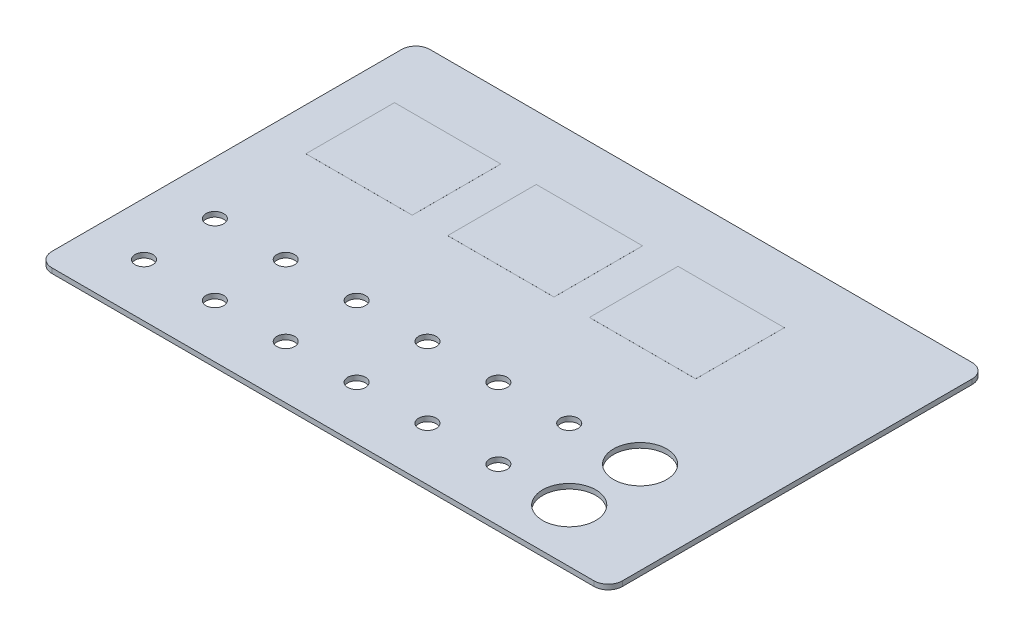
from build123d import *

# Parameters (mm, degrees)
SKETCH1_W           = 161
SKETCH1_H           = 106.7
BOSS_EXTRUDE1_DEPTH = 1.4
SKETCH2_R           = 2.5
SKETCH2_R_2         = 7.5
CUT_EXTRUDE1_DEPTH  = 195.336115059
SKETCH3_W           = 30
SKETCH3_H           = 25
BOSS_EXTRUDE2_DEPTH = 0.01
FILLET1_R           = 4


with BuildPart() as part:
    # Sketch1 → Boss-Extrude1 (new body)
    with BuildSketch(Plane(origin=(-75.623841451, 0, 44.972291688), x_dir=(1, 0, 0), z_dir=(0, 1, 0))):
        with Locations((81.418091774, 54.107420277)):
            Rectangle(SKETCH1_W, SKETCH1_H)
    extrude(amount=BOSS_EXTRUDE1_DEPTH)

    # Sketch2 → Cut-Extrude1 (cut, through all)
    with BuildSketch(Plane(origin=(-75.623841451, 1.4, 44.972291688), x_dir=(1, 0, 0), z_dir=(0, 1, 0))):
        with Locations(Location((15.918091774, 15.757420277, 0), (0, 0, 270))):
            Circle(SKETCH2_R)
        with Locations(Location((15.918091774, 35.757420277, 0), (0, 0, 270))):
            Circle(SKETCH2_R)
        with Locations(Location((35.918091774, 15.757420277, 0), (0, 0, 270))):
            Circle(SKETCH2_R)
        with Locations(Location((35.918091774, 35.757420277, 0), (0, 0, 270))):
            Circle(SKETCH2_R)
        with Locations(Location((55.918091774, 35.757420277, 0), (0, 0, 270))):
            Circle(SKETCH2_R)
        with Locations(Location((55.918091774, 15.757420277, 0), (0, 0, 270))):
            Circle(SKETCH2_R)
        with Locations(Location((75.918091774, 15.757420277, 0), (0, 0, 270))):
            Circle(SKETCH2_R)
        with Locations(Location((75.918091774, 35.757420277, 0), (0, 0, 270))):
            Circle(SKETCH2_R)
        with Locations(Location((95.918091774, 15.757420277, 0), (0, 0, 270))):
            Circle(SKETCH2_R)
        with Locations(Location((95.918091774, 35.757420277, 0), (0, 0, 270))):
            Circle(SKETCH2_R)
        with Locations(Location((115.918091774, 15.757420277, 0), (0, 0, 270))):
            Circle(SKETCH2_R)
        with Locations(Location((115.918091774, 35.757420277, 0), (0, 0, 270))):
            Circle(SKETCH2_R)
        with Locations(Location((135.918091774, 15.757420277, 0), (0, 0, 270))):
            Circle(SKETCH2_R_2)
        with Locations(Location((135.918091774, 35.757420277, 0), (0, 0, 270))):
            Circle(SKETCH2_R_2)
    extrude(amount=-CUT_EXTRUDE1_DEPTH, mode=Mode.SUBTRACT)

    # Sketch3 → Boss-Extrude2 (add)
    with BuildSketch(Plane(origin=(-75.623841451, 1.4, 44.972291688), x_dir=(1, 0, 0), z_dir=(0, 1, 0))):
        with Locations((27.918091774, 76.957420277)):
            Rectangle(SKETCH3_W, SKETCH3_H)
        with Locations((67.918091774, 76.957420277)):
            Rectangle(SKETCH3_W, SKETCH3_H)
        with Locations((107.918091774, 76.957420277)):
            Rectangle(SKETCH3_W, SKETCH3_H)
    extrude(amount=BOSS_EXTRUDE2_DEPTH)

    # Fillet1
    fillet1_edges = [part.edges().sort_by_distance(p)[0] for p in [
        (-74.705749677, 0.7, -62.485128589),
        (86.294250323, 0.7, -62.485128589),
        (86.294250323, 0.7, 44.214871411),
        (-74.705749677, 0.7, 44.214871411),
    ]]
    fillet(fillet1_edges, radius=FILLET1_R)


solid = part.part
